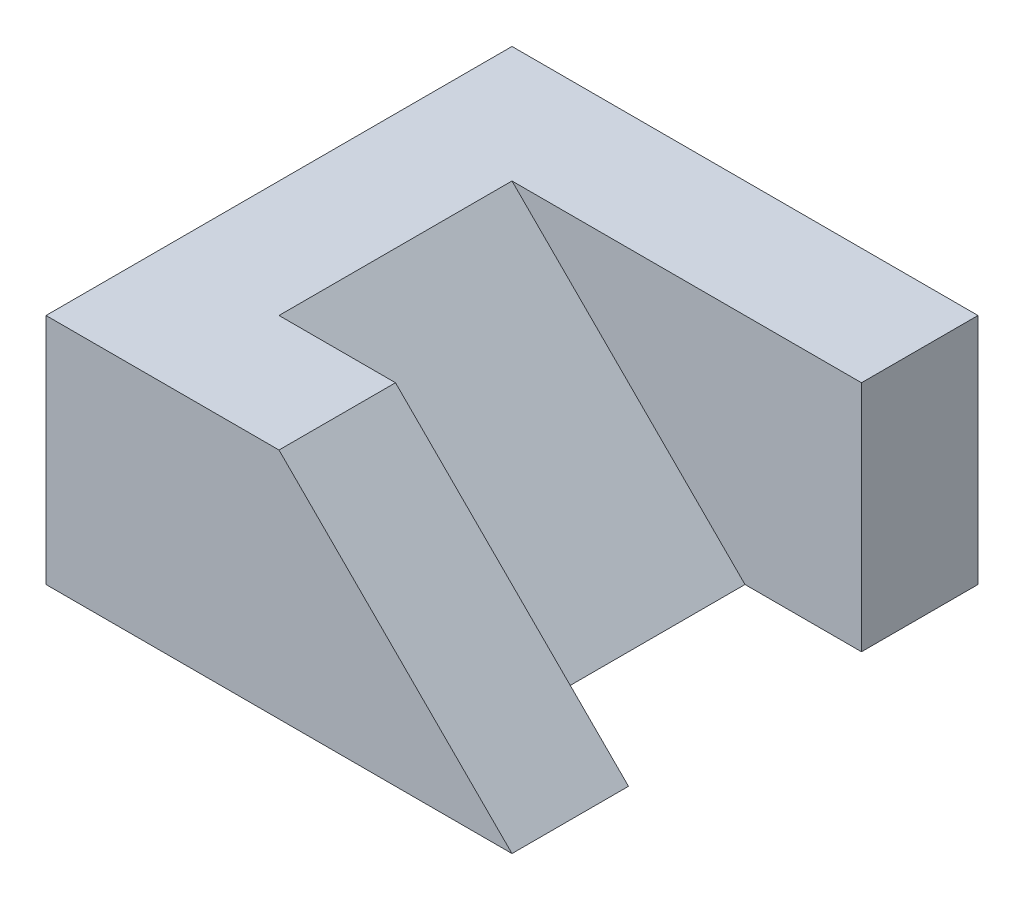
ISO-10303-21;
HEADER;
FILE_DESCRIPTION(('STEP AP214'),'2;1');
FILE_NAME('part.step','',(''),(''),'','','');
FILE_SCHEMA(('AUTOMOTIVE_DESIGN { 1 0 10303 214 1 1 1 1 }'));
ENDSEC;
DATA;
#1=APPLICATION_CONTEXT('core data for automotive mechanical design processes');
#2=APPLICATION_PROTOCOL_DEFINITION('international standard','automotive_design',2000,#1);
#3=PRODUCT_CONTEXT('',#1,'mechanical');
#4=PRODUCT('Part','Part','',(#3));
#5=PRODUCT_RELATED_PRODUCT_CATEGORY('part','',(#4));
#6=PRODUCT_DEFINITION_FORMATION('','',#4);
#7=PRODUCT_DEFINITION_CONTEXT('part definition',#1,'design');
#8=PRODUCT_DEFINITION('design','',#6,#7);
#9=PRODUCT_DEFINITION_SHAPE('','',#8);
#10=(LENGTH_UNIT() NAMED_UNIT(*) SI_UNIT(.MILLI.,.METRE.));
#11=(NAMED_UNIT(*) PLANE_ANGLE_UNIT() SI_UNIT($,.RADIAN.));
#12=(NAMED_UNIT(*) SI_UNIT($,.STERADIAN.) SOLID_ANGLE_UNIT());
#13=UNCERTAINTY_MEASURE_WITH_UNIT(LENGTH_MEASURE(1.E-05),#10,'distance_accuracy_value','');
#14=(GEOMETRIC_REPRESENTATION_CONTEXT(3) GLOBAL_UNCERTAINTY_ASSIGNED_CONTEXT((#13)) GLOBAL_UNIT_ASSIGNED_CONTEXT((#10,
#11,#12)) REPRESENTATION_CONTEXT('',''));
#15=CARTESIAN_POINT('',(0.,0.,0.));
#16=DIRECTION('',(0.,0.,1.));
#17=DIRECTION('',(1.,0.,0.));
#18=AXIS2_PLACEMENT_3D('',#15,#16,#17);
#19=CARTESIAN_POINT('',(0.,20.,-10.));
#20=DIRECTION('',(1.,0.,0.));
#21=DIRECTION('',(0.,0.,-1.));
#22=AXIS2_PLACEMENT_3D('',#19,#20,#21);
#23=PLANE('',#22);
#24=DIRECTION('',(0.,0.,1.));
#25=VECTOR('',#24,1.);
#26=CARTESIAN_POINT('',(0.,0.,-10.));
#27=LINE('',#26,#25);
#28=CARTESIAN_POINT('',(0.,0.,-20.));
#29=VERTEX_POINT('',#28);
#30=CARTESIAN_POINT('',(0.,0.,20.));
#31=VERTEX_POINT('',#30);
#32=EDGE_CURVE('E149',#29,#31,#27,.T.);
#33=ORIENTED_EDGE('',*,*,#32,.T.);
#34=DIRECTION('',(0.,-1.,0.));
#35=VECTOR('',#34,1.);
#36=CARTESIAN_POINT('',(0.,20.,20.));
#37=LINE('',#36,#35);
#38=CARTESIAN_POINT('',(0.,20.,20.));
#39=VERTEX_POINT('',#38);
#40=EDGE_CURVE('E96',#39,#31,#37,.T.);
#41=ORIENTED_EDGE('',*,*,#40,.F.);
#42=DIRECTION('',(0.,0.,1.));
#43=VECTOR('',#42,1.);
#44=CARTESIAN_POINT('',(0.,20.,-10.));
#45=LINE('',#44,#43);
#46=CARTESIAN_POINT('',(0.,20.,-20.));
#47=VERTEX_POINT('',#46);
#48=EDGE_CURVE('E11',#47,#39,#45,.T.);
#49=ORIENTED_EDGE('',*,*,#48,.F.);
#50=DIRECTION('',(0.,1.,0.));
#51=VECTOR('',#50,1.);
#52=CARTESIAN_POINT('',(0.,0.,-20.));
#53=LINE('',#52,#51);
#54=EDGE_CURVE('E94',#29,#47,#53,.T.);
#55=ORIENTED_EDGE('',*,*,#54,.F.);
#56=EDGE_LOOP('',(#33,#41,#49,#55));
#57=FACE_BOUND('',#56,.T.);
#58=ADVANCED_FACE('F30',(#57),#23,.F.);
#59=CARTESIAN_POINT('',(10.,20.,-10.));
#60=DIRECTION('',(0.,-1.,0.));
#61=DIRECTION('',(0.,0.,-1.));
#62=AXIS2_PLACEMENT_3D('',#59,#60,#61);
#63=PLANE('',#62);
#64=ORIENTED_EDGE('',*,*,#48,.T.);
#65=DIRECTION('',(-1.,0.,0.));
#66=VECTOR('',#65,1.);
#67=CARTESIAN_POINT('',(20.,20.,20.));
#68=LINE('',#67,#66);
#69=CARTESIAN_POINT('',(20.,20.,20.));
#70=VERTEX_POINT('',#69);
#71=EDGE_CURVE('E134',#70,#39,#68,.T.);
#72=ORIENTED_EDGE('',*,*,#71,.F.);
#73=DIRECTION('',(0.,0.,-1.));
#74=VECTOR('',#73,1.);
#75=CARTESIAN_POINT('',(20.,20.,20.));
#76=LINE('',#75,#74);
#77=CARTESIAN_POINT('',(20.,20.,10.));
#78=VERTEX_POINT('',#77);
#79=EDGE_CURVE('E136',#70,#78,#76,.T.);
#80=ORIENTED_EDGE('',*,*,#79,.T.);
#81=DIRECTION('',(-1.,0.,0.));
#82=VECTOR('',#81,1.);
#83=CARTESIAN_POINT('',(20.,20.,10.));
#84=LINE('',#83,#82);
#85=CARTESIAN_POINT('',(10.,20.,10.));
#86=VERTEX_POINT('',#85);
#87=EDGE_CURVE('E130',#78,#86,#84,.T.);
#88=ORIENTED_EDGE('',*,*,#87,.T.);
#89=DIRECTION('',(0.,0.,1.));
#90=VECTOR('',#89,1.);
#91=CARTESIAN_POINT('',(10.,20.,-10.));
#92=LINE('',#91,#90);
#93=CARTESIAN_POINT('',(10.,20.,-10.));
#94=VERTEX_POINT('',#93);
#95=EDGE_CURVE('E40',#94,#86,#92,.T.);
#96=ORIENTED_EDGE('',*,*,#95,.F.);
#97=DIRECTION('',(1.,0.,0.));
#98=VECTOR('',#97,1.);
#99=CARTESIAN_POINT('',(0.,20.,-10.));
#100=LINE('',#99,#98);
#101=CARTESIAN_POINT('',(40.,20.,-10.));
#102=VERTEX_POINT('',#101);
#103=EDGE_CURVE('E125',#94,#102,#100,.T.);
#104=ORIENTED_EDGE('',*,*,#103,.T.);
#105=DIRECTION('',(0.,0.,1.));
#106=VECTOR('',#105,1.);
#107=CARTESIAN_POINT('',(40.,20.,-20.));
#108=LINE('',#107,#106);
#109=CARTESIAN_POINT('',(40.,20.,-20.));
#110=VERTEX_POINT('',#109);
#111=EDGE_CURVE('E103',#110,#102,#108,.T.);
#112=ORIENTED_EDGE('',*,*,#111,.F.);
#113=DIRECTION('',(1.,0.,0.));
#114=VECTOR('',#113,1.);
#115=CARTESIAN_POINT('',(0.,20.,-20.));
#116=LINE('',#115,#114);
#117=EDGE_CURVE('E100',#47,#110,#116,.T.);
#118=ORIENTED_EDGE('',*,*,#117,.F.);
#119=EDGE_LOOP('',(#64,#72,#80,#88,#96,#104,#112,#118));
#120=FACE_BOUND('',#119,.T.);
#121=ADVANCED_FACE('F101',(#120),#63,.F.);
#122=CARTESIAN_POINT('',(30.,0.,-10.));
#123=DIRECTION('',(-0.707106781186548,-0.707106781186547,0.));
#124=DIRECTION('',(0.707106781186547,-0.707106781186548,0.));
#125=AXIS2_PLACEMENT_3D('',#122,#123,#124);
#126=PLANE('',#125);
#127=DIRECTION('',(0.707106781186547,-0.707106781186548,0.));
#128=VECTOR('',#127,1.);
#129=CARTESIAN_POINT('',(30.,0.,10.));
#130=LINE('',#129,#128);
#131=CARTESIAN_POINT('',(30.,0.,10.));
#132=VERTEX_POINT('',#131);
#133=EDGE_CURVE('E151',#86,#132,#130,.T.);
#134=ORIENTED_EDGE('',*,*,#133,.T.);
#135=DIRECTION('',(0.,0.,1.));
#136=VECTOR('',#135,1.);
#137=CARTESIAN_POINT('',(30.,0.,-10.));
#138=LINE('',#137,#136);
#139=CARTESIAN_POINT('',(30.,0.,-10.));
#140=VERTEX_POINT('',#139);
#141=EDGE_CURVE('E155',#140,#132,#138,.T.);
#142=ORIENTED_EDGE('',*,*,#141,.F.);
#143=DIRECTION('',(0.707106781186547,-0.707106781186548,0.));
#144=VECTOR('',#143,1.);
#145=CARTESIAN_POINT('',(30.,0.,-10.));
#146=LINE('',#145,#144);
#147=EDGE_CURVE('E33',#94,#140,#146,.T.);
#148=ORIENTED_EDGE('',*,*,#147,.F.);
#149=ORIENTED_EDGE('',*,*,#95,.T.);
#150=EDGE_LOOP('',(#134,#142,#148,#149));
#151=FACE_BOUND('',#150,.T.);
#152=ADVANCED_FACE('F162',(#151),#126,.F.);
#153=CARTESIAN_POINT('',(0.,0.,-10.));
#154=DIRECTION('',(0.,1.,0.));
#155=DIRECTION('',(0.,0.,1.));
#156=AXIS2_PLACEMENT_3D('',#153,#154,#155);
#157=PLANE('',#156);
#158=ORIENTED_EDGE('',*,*,#141,.T.);
#159=DIRECTION('',(1.,0.,0.));
#160=VECTOR('',#159,1.);
#161=CARTESIAN_POINT('',(0.,0.,10.));
#162=LINE('',#161,#160);
#163=CARTESIAN_POINT('',(40.,0.,10.));
#164=VERTEX_POINT('',#163);
#165=EDGE_CURVE('E142',#132,#164,#162,.T.);
#166=ORIENTED_EDGE('',*,*,#165,.T.);
#167=DIRECTION('',(0.,0.,-1.));
#168=VECTOR('',#167,1.);
#169=CARTESIAN_POINT('',(40.,0.,20.));
#170=LINE('',#169,#168);
#171=CARTESIAN_POINT('',(40.,0.,20.));
#172=VERTEX_POINT('',#171);
#173=EDGE_CURVE('E154',#172,#164,#170,.T.);
#174=ORIENTED_EDGE('',*,*,#173,.F.);
#175=DIRECTION('',(1.,0.,0.));
#176=VECTOR('',#175,1.);
#177=CARTESIAN_POINT('',(0.,0.,20.));
#178=LINE('',#177,#176);
#179=EDGE_CURVE('E129',#31,#172,#178,.T.);
#180=ORIENTED_EDGE('',*,*,#179,.F.);
#181=ORIENTED_EDGE('',*,*,#32,.F.);
#182=DIRECTION('',(-1.,0.,0.));
#183=VECTOR('',#182,1.);
#184=CARTESIAN_POINT('',(0.,0.,-20.));
#185=LINE('',#184,#183);
#186=CARTESIAN_POINT('',(40.,0.,-20.));
#187=VERTEX_POINT('',#186);
#188=EDGE_CURVE('E111',#187,#29,#185,.T.);
#189=ORIENTED_EDGE('',*,*,#188,.F.);
#190=DIRECTION('',(0.,0.,1.));
#191=VECTOR('',#190,1.);
#192=CARTESIAN_POINT('',(40.,0.,-20.));
#193=LINE('',#192,#191);
#194=CARTESIAN_POINT('',(40.,0.,-10.));
#195=VERTEX_POINT('',#194);
#196=EDGE_CURVE('E120',#187,#195,#193,.T.);
#197=ORIENTED_EDGE('',*,*,#196,.T.);
#198=DIRECTION('',(-1.,0.,0.));
#199=VECTOR('',#198,1.);
#200=CARTESIAN_POINT('',(0.,0.,-10.));
#201=LINE('',#200,#199);
#202=EDGE_CURVE('E112',#195,#140,#201,.T.);
#203=ORIENTED_EDGE('',*,*,#202,.T.);
#204=EDGE_LOOP('',(#158,#166,#174,#180,#181,#189,#197,#203));
#205=FACE_BOUND('',#204,.T.);
#206=ADVANCED_FACE('F176',(#205),#157,.F.);
#207=CARTESIAN_POINT('',(40.,0.,20.));
#208=DIRECTION('',(-0.707106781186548,-0.707106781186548,0.));
#209=DIRECTION('',(0.707106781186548,-0.707106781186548,0.));
#210=AXIS2_PLACEMENT_3D('',#207,#208,#209);
#211=PLANE('',#210);
#212=DIRECTION('',(-0.707106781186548,0.707106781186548,0.));
#213=VECTOR('',#212,1.);
#214=CARTESIAN_POINT('',(40.,0.,10.));
#215=LINE('',#214,#213);
#216=EDGE_CURVE('E139',#164,#78,#215,.T.);
#217=ORIENTED_EDGE('',*,*,#216,.T.);
#218=ORIENTED_EDGE('',*,*,#79,.F.);
#219=DIRECTION('',(-0.707106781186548,0.707106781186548,0.));
#220=VECTOR('',#219,1.);
#221=CARTESIAN_POINT('',(40.,0.,20.));
#222=LINE('',#221,#220);
#223=EDGE_CURVE('E132',#172,#70,#222,.T.);
#224=ORIENTED_EDGE('',*,*,#223,.F.);
#225=ORIENTED_EDGE('',*,*,#173,.T.);
#226=EDGE_LOOP('',(#217,#218,#224,#225));
#227=FACE_BOUND('',#226,.T.);
#228=ADVANCED_FACE('F191',(#227),#211,.F.);
#229=CARTESIAN_POINT('',(0.,0.,20.));
#230=DIRECTION('',(0.,0.,1.));
#231=DIRECTION('',(1.,0.,0.));
#232=AXIS2_PLACEMENT_3D('',#229,#230,#231);
#233=PLANE('',#232);
#234=ORIENTED_EDGE('',*,*,#40,.T.);
#235=ORIENTED_EDGE('',*,*,#179,.T.);
#236=ORIENTED_EDGE('',*,*,#223,.T.);
#237=ORIENTED_EDGE('',*,*,#71,.T.);
#238=EDGE_LOOP('',(#234,#235,#236,#237));
#239=FACE_BOUND('',#238,.T.);
#240=ADVANCED_FACE('F182',(#239),#233,.T.);
#241=CARTESIAN_POINT('',(0.,0.,10.));
#242=DIRECTION('',(0.,0.,1.));
#243=DIRECTION('',(1.,0.,0.));
#244=AXIS2_PLACEMENT_3D('',#241,#242,#243);
#245=PLANE('',#244);
#246=ORIENTED_EDGE('',*,*,#133,.F.);
#247=ORIENTED_EDGE('',*,*,#87,.F.);
#248=ORIENTED_EDGE('',*,*,#216,.F.);
#249=ORIENTED_EDGE('',*,*,#165,.F.);
#250=EDGE_LOOP('',(#246,#247,#248,#249));
#251=FACE_BOUND('',#250,.T.);
#252=ADVANCED_FACE('F190',(#251),#245,.F.);
#253=CARTESIAN_POINT('',(0.,20.,-10.));
#254=DIRECTION('',(0.,0.,-1.));
#255=DIRECTION('',(-1.,0.,0.));
#256=AXIS2_PLACEMENT_3D('',#253,#254,#255);
#257=PLANE('',#256);
#258=ORIENTED_EDGE('',*,*,#103,.F.);
#259=ORIENTED_EDGE('',*,*,#147,.T.);
#260=ORIENTED_EDGE('',*,*,#202,.F.);
#261=DIRECTION('',(0.,-1.,0.));
#262=VECTOR('',#261,1.);
#263=CARTESIAN_POINT('',(40.,0.,-10.));
#264=LINE('',#263,#262);
#265=EDGE_CURVE('E115',#102,#195,#264,.T.);
#266=ORIENTED_EDGE('',*,*,#265,.F.);
#267=EDGE_LOOP('',(#258,#259,#260,#266));
#268=FACE_BOUND('',#267,.T.);
#269=ADVANCED_FACE('F168',(#268),#257,.F.);
#270=CARTESIAN_POINT('',(40.,0.,-20.));
#271=DIRECTION('',(-1.,0.,0.));
#272=DIRECTION('',(0.,0.,1.));
#273=AXIS2_PLACEMENT_3D('',#270,#271,#272);
#274=PLANE('',#273);
#275=ORIENTED_EDGE('',*,*,#265,.T.);
#276=ORIENTED_EDGE('',*,*,#196,.F.);
#277=DIRECTION('',(0.,-1.,0.));
#278=VECTOR('',#277,1.);
#279=CARTESIAN_POINT('',(40.,0.,-20.));
#280=LINE('',#279,#278);
#281=EDGE_CURVE('E106',#110,#187,#280,.T.);
#282=ORIENTED_EDGE('',*,*,#281,.F.);
#283=ORIENTED_EDGE('',*,*,#111,.T.);
#284=EDGE_LOOP('',(#275,#276,#282,#283));
#285=FACE_BOUND('',#284,.T.);
#286=ADVANCED_FACE('F170',(#285),#274,.F.);
#287=CARTESIAN_POINT('',(0.,20.,-20.));
#288=DIRECTION('',(0.,0.,-1.));
#289=DIRECTION('',(-1.,0.,0.));
#290=AXIS2_PLACEMENT_3D('',#287,#288,#289);
#291=PLANE('',#290);
#292=ORIENTED_EDGE('',*,*,#54,.T.);
#293=ORIENTED_EDGE('',*,*,#117,.T.);
#294=ORIENTED_EDGE('',*,*,#281,.T.);
#295=ORIENTED_EDGE('',*,*,#188,.T.);
#296=EDGE_LOOP('',(#292,#293,#294,#295));
#297=FACE_BOUND('',#296,.T.);
#298=ADVANCED_FACE('F109',(#297),#291,.T.);
#299=CLOSED_SHELL('',(#58,#121,#152,#206,#228,#240,#252,#269,#286,#298));
#300=MANIFOLD_SOLID_BREP('B2',#299);
#301=ADVANCED_BREP_SHAPE_REPRESENTATION('',(#18,#300),#14);
#302=SHAPE_DEFINITION_REPRESENTATION(#9,#301);
ENDSEC;
END-ISO-10303-21;
